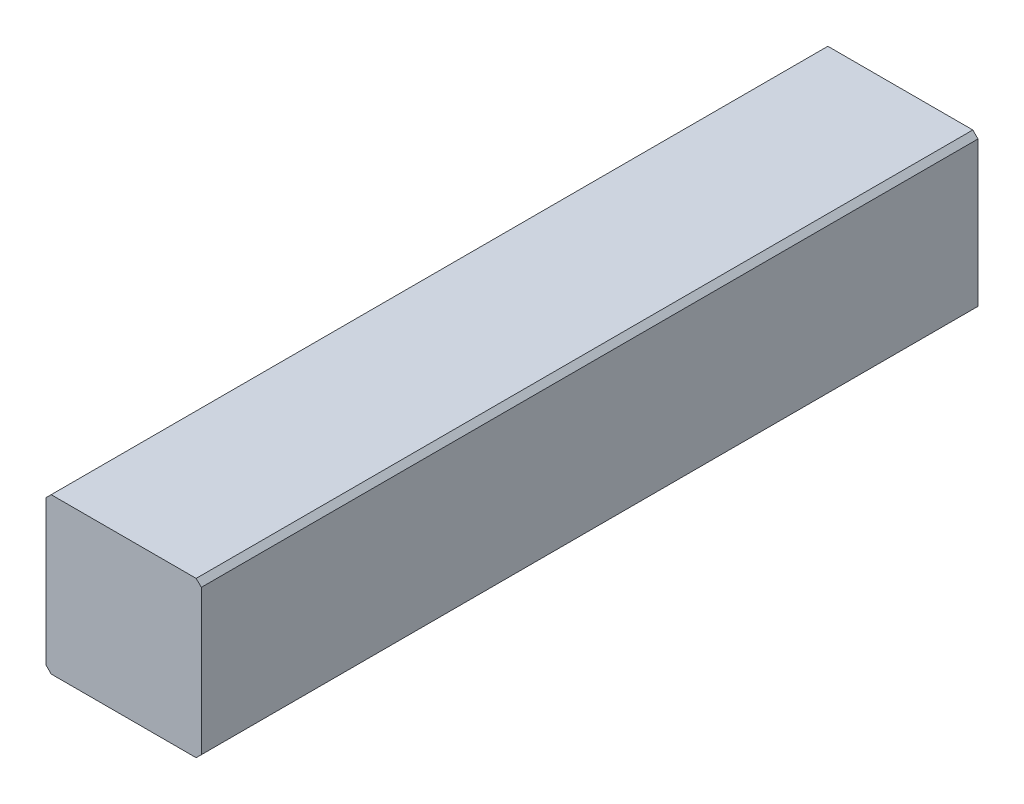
ISO-10303-21;
HEADER;
FILE_DESCRIPTION(('STEP AP214'),'2;1');
FILE_NAME('part.step','',(''),(''),'','','');
FILE_SCHEMA(('AUTOMOTIVE_DESIGN { 1 0 10303 214 1 1 1 1 }'));
ENDSEC;
DATA;
#1=APPLICATION_CONTEXT('core data for automotive mechanical design processes');
#2=APPLICATION_PROTOCOL_DEFINITION('international standard','automotive_design',2000,#1);
#3=PRODUCT_CONTEXT('',#1,'mechanical');
#4=PRODUCT('Part','Part','',(#3));
#5=PRODUCT_RELATED_PRODUCT_CATEGORY('part','',(#4));
#6=PRODUCT_DEFINITION_FORMATION('','',#4);
#7=PRODUCT_DEFINITION_CONTEXT('part definition',#1,'design');
#8=PRODUCT_DEFINITION('design','',#6,#7);
#9=PRODUCT_DEFINITION_SHAPE('','',#8);
#10=(LENGTH_UNIT() NAMED_UNIT(*) SI_UNIT(.MILLI.,.METRE.));
#11=(NAMED_UNIT(*) PLANE_ANGLE_UNIT() SI_UNIT($,.RADIAN.));
#12=(NAMED_UNIT(*) SI_UNIT($,.STERADIAN.) SOLID_ANGLE_UNIT());
#13=UNCERTAINTY_MEASURE_WITH_UNIT(LENGTH_MEASURE(1.E-05),#10,'distance_accuracy_value','');
#14=(GEOMETRIC_REPRESENTATION_CONTEXT(3) GLOBAL_UNCERTAINTY_ASSIGNED_CONTEXT((#13)) GLOBAL_UNIT_ASSIGNED_CONTEXT((#10,
#11,#12)) REPRESENTATION_CONTEXT('',''));
#15=CARTESIAN_POINT('',(0.,0.,0.));
#16=DIRECTION('',(0.,0.,1.));
#17=DIRECTION('',(1.,0.,0.));
#18=AXIS2_PLACEMENT_3D('',#15,#16,#17);
#19=CARTESIAN_POINT('',(-3.,-3.,15.));
#20=DIRECTION('',(1.,0.,0.));
#21=DIRECTION('',(0.,0.,-1.));
#22=AXIS2_PLACEMENT_3D('',#19,#20,#21);
#23=PLANE('',#22);
#24=DIRECTION('',(0.,-1.,0.));
#25=VECTOR('',#24,1.);
#26=CARTESIAN_POINT('',(-3.,-3.,-15.));
#27=LINE('',#26,#25);
#28=CARTESIAN_POINT('',(-3.,2.8,-15.));
#29=VERTEX_POINT('',#28);
#30=CARTESIAN_POINT('',(-3.,-2.8,-15.));
#31=VERTEX_POINT('',#30);
#32=EDGE_CURVE('E121',#29,#31,#27,.T.);
#33=ORIENTED_EDGE('',*,*,#32,.T.);
#34=DIRECTION('',(0.,0.,1.));
#35=VECTOR('',#34,1.);
#36=CARTESIAN_POINT('',(-3.,-2.8,15.));
#37=LINE('',#36,#35);
#38=CARTESIAN_POINT('',(-3.,-2.8,15.));
#39=VERTEX_POINT('',#38);
#40=EDGE_CURVE('E99',#31,#39,#37,.T.);
#41=ORIENTED_EDGE('',*,*,#40,.T.);
#42=DIRECTION('',(0.,-1.,0.));
#43=VECTOR('',#42,1.);
#44=CARTESIAN_POINT('',(-3.,-3.,15.));
#45=LINE('',#44,#43);
#46=CARTESIAN_POINT('',(-3.,2.8,15.));
#47=VERTEX_POINT('',#46);
#48=EDGE_CURVE('E129',#47,#39,#45,.T.);
#49=ORIENTED_EDGE('',*,*,#48,.F.);
#50=DIRECTION('',(0.,0.,-1.));
#51=VECTOR('',#50,1.);
#52=CARTESIAN_POINT('',(-3.,2.8,15.));
#53=LINE('',#52,#51);
#54=EDGE_CURVE('E104',#47,#29,#53,.T.);
#55=ORIENTED_EDGE('',*,*,#54,.T.);
#56=EDGE_LOOP('',(#33,#41,#49,#55));
#57=FACE_BOUND('',#56,.T.);
#58=ADVANCED_FACE('F30',(#57),#23,.F.);
#59=CARTESIAN_POINT('',(-3.,-3.,15.));
#60=DIRECTION('',(0.,1.,0.));
#61=DIRECTION('',(0.,0.,1.));
#62=AXIS2_PLACEMENT_3D('',#59,#60,#61);
#63=PLANE('',#62);
#64=DIRECTION('',(1.,0.,0.));
#65=VECTOR('',#64,1.);
#66=CARTESIAN_POINT('',(-3.,-3.,15.));
#67=LINE('',#66,#65);
#68=CARTESIAN_POINT('',(-2.8,-3.,15.));
#69=VERTEX_POINT('',#68);
#70=CARTESIAN_POINT('',(2.8,-3.,15.));
#71=VERTEX_POINT('',#70);
#72=EDGE_CURVE('E114',#69,#71,#67,.T.);
#73=ORIENTED_EDGE('',*,*,#72,.F.);
#74=DIRECTION('',(0.,0.,-1.));
#75=VECTOR('',#74,1.);
#76=CARTESIAN_POINT('',(-2.8,-3.,15.));
#77=LINE('',#76,#75);
#78=CARTESIAN_POINT('',(-2.8,-3.,-15.));
#79=VERTEX_POINT('',#78);
#80=EDGE_CURVE('E98',#69,#79,#77,.T.);
#81=ORIENTED_EDGE('',*,*,#80,.T.);
#82=DIRECTION('',(1.,0.,0.));
#83=VECTOR('',#82,1.);
#84=CARTESIAN_POINT('',(-3.,-3.,-15.));
#85=LINE('',#84,#83);
#86=CARTESIAN_POINT('',(2.8,-3.,-15.));
#87=VERTEX_POINT('',#86);
#88=EDGE_CURVE('E111',#79,#87,#85,.T.);
#89=ORIENTED_EDGE('',*,*,#88,.T.);
#90=DIRECTION('',(0.,0.,1.));
#91=VECTOR('',#90,1.);
#92=CARTESIAN_POINT('',(2.8,-3.,15.));
#93=LINE('',#92,#91);
#94=EDGE_CURVE('E116',#87,#71,#93,.T.);
#95=ORIENTED_EDGE('',*,*,#94,.T.);
#96=EDGE_LOOP('',(#73,#81,#89,#95));
#97=FACE_BOUND('',#96,.T.);
#98=ADVANCED_FACE('F110',(#97),#63,.F.);
#99=CARTESIAN_POINT('',(3.,-3.,15.));
#100=DIRECTION('',(-1.,0.,0.));
#101=DIRECTION('',(0.,0.,1.));
#102=AXIS2_PLACEMENT_3D('',#99,#100,#101);
#103=PLANE('',#102);
#104=DIRECTION('',(0.,1.,0.));
#105=VECTOR('',#104,1.);
#106=CARTESIAN_POINT('',(3.,-3.,15.));
#107=LINE('',#106,#105);
#108=CARTESIAN_POINT('',(3.,-2.8,15.));
#109=VERTEX_POINT('',#108);
#110=CARTESIAN_POINT('',(3.,2.8,15.));
#111=VERTEX_POINT('',#110);
#112=EDGE_CURVE('E133',#109,#111,#107,.T.);
#113=ORIENTED_EDGE('',*,*,#112,.F.);
#114=DIRECTION('',(0.,0.,-1.));
#115=VECTOR('',#114,1.);
#116=CARTESIAN_POINT('',(3.,-2.8,15.));
#117=LINE('',#116,#115);
#118=CARTESIAN_POINT('',(3.,-2.8,-15.));
#119=VERTEX_POINT('',#118);
#120=EDGE_CURVE('E154',#109,#119,#117,.T.);
#121=ORIENTED_EDGE('',*,*,#120,.T.);
#122=DIRECTION('',(0.,1.,0.));
#123=VECTOR('',#122,1.);
#124=CARTESIAN_POINT('',(3.,-3.,-15.));
#125=LINE('',#124,#123);
#126=CARTESIAN_POINT('',(3.,2.8,-15.));
#127=VERTEX_POINT('',#126);
#128=EDGE_CURVE('E120',#119,#127,#125,.T.);
#129=ORIENTED_EDGE('',*,*,#128,.T.);
#130=DIRECTION('',(0.,0.,1.));
#131=VECTOR('',#130,1.);
#132=CARTESIAN_POINT('',(3.,2.8,15.));
#133=LINE('',#132,#131);
#134=EDGE_CURVE('E152',#127,#111,#133,.T.);
#135=ORIENTED_EDGE('',*,*,#134,.T.);
#136=EDGE_LOOP('',(#113,#121,#129,#135));
#137=FACE_BOUND('',#136,.T.);
#138=ADVANCED_FACE('F174',(#137),#103,.F.);
#139=CARTESIAN_POINT('',(-3.,3.,15.));
#140=DIRECTION('',(0.,-1.,0.));
#141=DIRECTION('',(0.,0.,-1.));
#142=AXIS2_PLACEMENT_3D('',#139,#140,#141);
#143=PLANE('',#142);
#144=DIRECTION('',(-1.,0.,0.));
#145=VECTOR('',#144,1.);
#146=CARTESIAN_POINT('',(-3.,3.,-15.));
#147=LINE('',#146,#145);
#148=CARTESIAN_POINT('',(2.8,3.,-15.));
#149=VERTEX_POINT('',#148);
#150=CARTESIAN_POINT('',(-2.8,3.,-15.));
#151=VERTEX_POINT('',#150);
#152=EDGE_CURVE('E124',#149,#151,#147,.T.);
#153=ORIENTED_EDGE('',*,*,#152,.T.);
#154=DIRECTION('',(0.,0.,1.));
#155=VECTOR('',#154,1.);
#156=CARTESIAN_POINT('',(-2.8,3.,15.));
#157=LINE('',#156,#155);
#158=CARTESIAN_POINT('',(-2.8,3.,15.));
#159=VERTEX_POINT('',#158);
#160=EDGE_CURVE('E11',#151,#159,#157,.T.);
#161=ORIENTED_EDGE('',*,*,#160,.T.);
#162=DIRECTION('',(-1.,0.,0.));
#163=VECTOR('',#162,1.);
#164=CARTESIAN_POINT('',(-3.,3.,15.));
#165=LINE('',#164,#163);
#166=CARTESIAN_POINT('',(2.8,3.,15.));
#167=VERTEX_POINT('',#166);
#168=EDGE_CURVE('E135',#167,#159,#165,.T.);
#169=ORIENTED_EDGE('',*,*,#168,.F.);
#170=DIRECTION('',(0.,0.,-1.));
#171=VECTOR('',#170,1.);
#172=CARTESIAN_POINT('',(2.8,3.,15.));
#173=LINE('',#172,#171);
#174=EDGE_CURVE('E37',#167,#149,#173,.T.);
#175=ORIENTED_EDGE('',*,*,#174,.T.);
#176=EDGE_LOOP('',(#153,#161,#169,#175));
#177=FACE_BOUND('',#176,.T.);
#178=ADVANCED_FACE('F159',(#177),#143,.F.);
#179=CARTESIAN_POINT('',(-3.,3.,15.));
#180=DIRECTION('',(0.,0.,-1.));
#181=DIRECTION('',(-1.,0.,0.));
#182=AXIS2_PLACEMENT_3D('',#179,#180,#181);
#183=PLANE('',#182);
#184=ORIENTED_EDGE('',*,*,#48,.T.);
#185=DIRECTION('',(-0.707106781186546,0.707106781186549,0.));
#186=VECTOR('',#185,1.);
#187=CARTESIAN_POINT('',(-2.8,-3.,15.));
#188=LINE('',#187,#186);
#189=EDGE_CURVE('E150',#39,#69,#188,.F.);
#190=ORIENTED_EDGE('',*,*,#189,.T.);
#191=ORIENTED_EDGE('',*,*,#72,.T.);
#192=DIRECTION('',(-0.707106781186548,-0.707106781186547,0.));
#193=VECTOR('',#192,1.);
#194=CARTESIAN_POINT('',(3.,-2.8,15.));
#195=LINE('',#194,#193);
#196=EDGE_CURVE('E148',#71,#109,#195,.F.);
#197=ORIENTED_EDGE('',*,*,#196,.T.);
#198=ORIENTED_EDGE('',*,*,#112,.T.);
#199=DIRECTION('',(0.707106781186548,-0.707106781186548,0.));
#200=VECTOR('',#199,1.);
#201=CARTESIAN_POINT('',(2.8,3.,15.));
#202=LINE('',#201,#200);
#203=EDGE_CURVE('E49',#111,#167,#202,.F.);
#204=ORIENTED_EDGE('',*,*,#203,.T.);
#205=ORIENTED_EDGE('',*,*,#168,.T.);
#206=DIRECTION('',(0.707106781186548,0.707106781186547,0.));
#207=VECTOR('',#206,1.);
#208=CARTESIAN_POINT('',(-3.,2.8,15.));
#209=LINE('',#208,#207);
#210=EDGE_CURVE('E146',#159,#47,#209,.F.);
#211=ORIENTED_EDGE('',*,*,#210,.T.);
#212=EDGE_LOOP('',(#184,#190,#191,#197,#198,#204,#205,#211));
#213=FACE_BOUND('',#212,.T.);
#214=ADVANCED_FACE('F167',(#213),#183,.F.);
#215=CARTESIAN_POINT('',(-3.,3.,-15.));
#216=DIRECTION('',(0.,0.,-1.));
#217=DIRECTION('',(-1.,0.,0.));
#218=AXIS2_PLACEMENT_3D('',#215,#216,#217);
#219=PLANE('',#218);
#220=ORIENTED_EDGE('',*,*,#88,.F.);
#221=DIRECTION('',(0.707106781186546,-0.707106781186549,0.));
#222=VECTOR('',#221,1.);
#223=CARTESIAN_POINT('',(-5.9,0.100000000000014,-15.));
#224=LINE('',#223,#222);
#225=EDGE_CURVE('E94',#79,#31,#224,.F.);
#226=ORIENTED_EDGE('',*,*,#225,.T.);
#227=ORIENTED_EDGE('',*,*,#32,.F.);
#228=DIRECTION('',(-0.707106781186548,-0.707106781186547,0.));
#229=VECTOR('',#228,1.);
#230=CARTESIAN_POINT('',(-2.9,2.9,-15.));
#231=LINE('',#230,#229);
#232=EDGE_CURVE('E139',#29,#151,#231,.F.);
#233=ORIENTED_EDGE('',*,*,#232,.T.);
#234=ORIENTED_EDGE('',*,*,#152,.F.);
#235=DIRECTION('',(-0.707106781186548,0.707106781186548,0.));
#236=VECTOR('',#235,1.);
#237=CARTESIAN_POINT('',(-0.1,5.9,-15.));
#238=LINE('',#237,#236);
#239=EDGE_CURVE('E115',#149,#127,#238,.F.);
#240=ORIENTED_EDGE('',*,*,#239,.T.);
#241=ORIENTED_EDGE('',*,*,#128,.F.);
#242=DIRECTION('',(0.707106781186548,0.707106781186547,0.));
#243=VECTOR('',#242,1.);
#244=CARTESIAN_POINT('',(2.89999999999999,-2.9,-15.));
#245=LINE('',#244,#243);
#246=EDGE_CURVE('E105',#119,#87,#245,.F.);
#247=ORIENTED_EDGE('',*,*,#246,.T.);
#248=EDGE_LOOP('',(#220,#226,#227,#233,#234,#240,#241,#247));
#249=FACE_BOUND('',#248,.T.);
#250=ADVANCED_FACE('F118',(#249),#219,.T.);
#251=CARTESIAN_POINT('',(-2.8,-3.,15.));
#252=DIRECTION('',(0.707106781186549,0.707106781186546,0.));
#253=DIRECTION('',(-0.707106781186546,0.707106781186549,0.));
#254=AXIS2_PLACEMENT_3D('',#251,#252,#253);
#255=PLANE('',#254);
#256=ORIENTED_EDGE('',*,*,#189,.F.);
#257=ORIENTED_EDGE('',*,*,#40,.F.);
#258=ORIENTED_EDGE('',*,*,#225,.F.);
#259=ORIENTED_EDGE('',*,*,#80,.F.);
#260=EDGE_LOOP('',(#256,#257,#258,#259));
#261=FACE_BOUND('',#260,.T.);
#262=ADVANCED_FACE('F97',(#261),#255,.F.);
#263=CARTESIAN_POINT('',(3.,-2.8,15.));
#264=DIRECTION('',(-0.707106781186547,0.707106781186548,0.));
#265=DIRECTION('',(-0.707106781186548,-0.707106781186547,0.));
#266=AXIS2_PLACEMENT_3D('',#263,#264,#265);
#267=PLANE('',#266);
#268=ORIENTED_EDGE('',*,*,#196,.F.);
#269=ORIENTED_EDGE('',*,*,#94,.F.);
#270=ORIENTED_EDGE('',*,*,#246,.F.);
#271=ORIENTED_EDGE('',*,*,#120,.F.);
#272=EDGE_LOOP('',(#268,#269,#270,#271));
#273=FACE_BOUND('',#272,.T.);
#274=ADVANCED_FACE('F172',(#273),#267,.F.);
#275=CARTESIAN_POINT('',(-3.,2.8,15.));
#276=DIRECTION('',(0.707106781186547,-0.707106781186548,0.));
#277=DIRECTION('',(0.707106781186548,0.707106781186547,0.));
#278=AXIS2_PLACEMENT_3D('',#275,#276,#277);
#279=PLANE('',#278);
#280=ORIENTED_EDGE('',*,*,#210,.F.);
#281=ORIENTED_EDGE('',*,*,#160,.F.);
#282=ORIENTED_EDGE('',*,*,#232,.F.);
#283=ORIENTED_EDGE('',*,*,#54,.F.);
#284=EDGE_LOOP('',(#280,#281,#282,#283));
#285=FACE_BOUND('',#284,.T.);
#286=ADVANCED_FACE('F164',(#285),#279,.F.);
#287=CARTESIAN_POINT('',(2.8,3.,15.));
#288=DIRECTION('',(-0.707106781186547,-0.707106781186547,0.));
#289=DIRECTION('',(0.707106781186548,-0.707106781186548,0.));
#290=AXIS2_PLACEMENT_3D('',#287,#288,#289);
#291=PLANE('',#290);
#292=ORIENTED_EDGE('',*,*,#203,.F.);
#293=ORIENTED_EDGE('',*,*,#134,.F.);
#294=ORIENTED_EDGE('',*,*,#239,.F.);
#295=ORIENTED_EDGE('',*,*,#174,.F.);
#296=EDGE_LOOP('',(#292,#293,#294,#295));
#297=FACE_BOUND('',#296,.T.);
#298=ADVANCED_FACE('F176',(#297),#291,.F.);
#299=CLOSED_SHELL('',(#58,#98,#138,#178,#214,#250,#262,#274,#286,#298));
#300=MANIFOLD_SOLID_BREP('B2',#299);
#301=ADVANCED_BREP_SHAPE_REPRESENTATION('',(#18,#300),#14);
#302=SHAPE_DEFINITION_REPRESENTATION(#9,#301);
ENDSEC;
END-ISO-10303-21;
